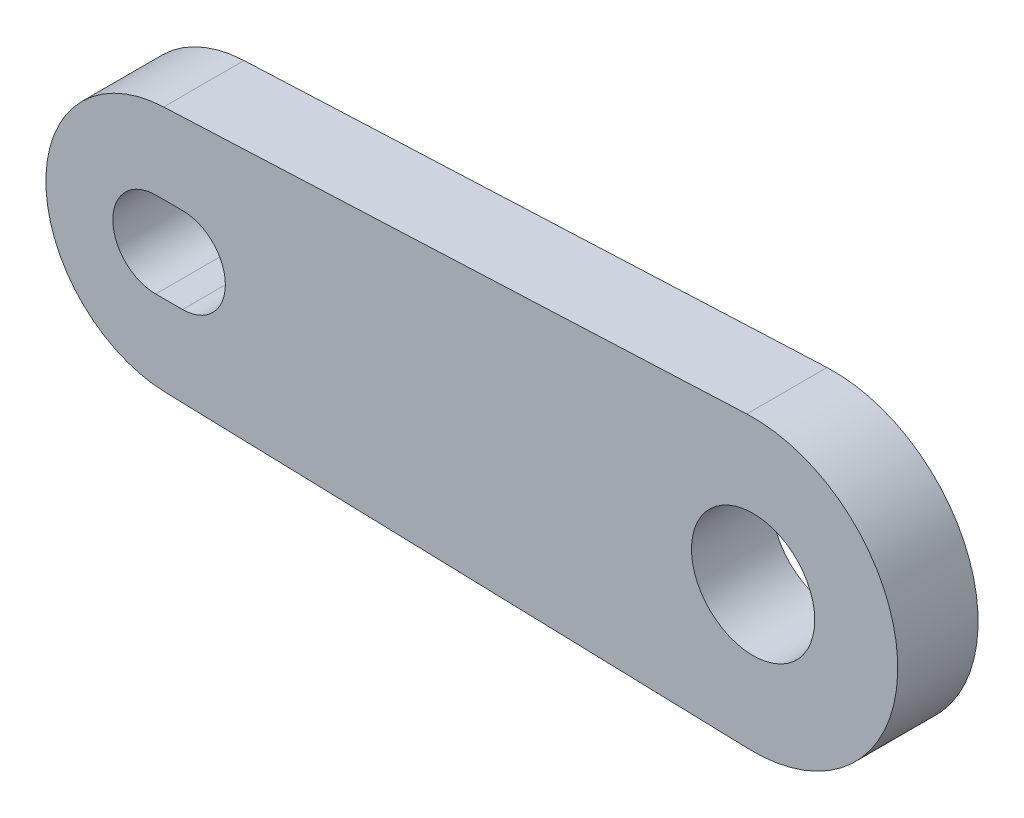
ISO-10303-21;
HEADER;
FILE_DESCRIPTION(('STEP AP214'),'2;1');
FILE_NAME('part.step','',(''),(''),'','','');
FILE_SCHEMA(('AUTOMOTIVE_DESIGN { 1 0 10303 214 1 1 1 1 }'));
ENDSEC;
DATA;
#1=APPLICATION_CONTEXT('core data for automotive mechanical design processes');
#2=APPLICATION_PROTOCOL_DEFINITION('international standard','automotive_design',2000,#1);
#3=PRODUCT_CONTEXT('',#1,'mechanical');
#4=PRODUCT('Part','Part','',(#3));
#5=PRODUCT_RELATED_PRODUCT_CATEGORY('part','',(#4));
#6=PRODUCT_DEFINITION_FORMATION('','',#4);
#7=PRODUCT_DEFINITION_CONTEXT('part definition',#1,'design');
#8=PRODUCT_DEFINITION('design','',#6,#7);
#9=PRODUCT_DEFINITION_SHAPE('','',#8);
#10=(LENGTH_UNIT() NAMED_UNIT(*) SI_UNIT(.MILLI.,.METRE.));
#11=(NAMED_UNIT(*) PLANE_ANGLE_UNIT() SI_UNIT($,.RADIAN.));
#12=(NAMED_UNIT(*) SI_UNIT($,.STERADIAN.) SOLID_ANGLE_UNIT());
#13=UNCERTAINTY_MEASURE_WITH_UNIT(LENGTH_MEASURE(1.E-05),#10,'distance_accuracy_value','');
#14=(GEOMETRIC_REPRESENTATION_CONTEXT(3) GLOBAL_UNCERTAINTY_ASSIGNED_CONTEXT((#13)) GLOBAL_UNIT_ASSIGNED_CONTEXT((#10,
#11,#12)) REPRESENTATION_CONTEXT('',''));
#15=CARTESIAN_POINT('',(0.,0.,0.));
#16=DIRECTION('',(0.,0.,1.));
#17=DIRECTION('',(1.,0.,0.));
#18=AXIS2_PLACEMENT_3D('',#15,#16,#17);
#19=CARTESIAN_POINT('',(0.0996517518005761,-5.24130689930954,-4.48174513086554));
#20=DIRECTION('',(0.,0.,1.));
#21=DIRECTION('',(1.,0.,0.));
#22=AXIS2_PLACEMENT_3D('',#19,#20,#21);
#23=PLANE('',#22);
#24=DIRECTION('',(1.,0.,0.));
#25=VECTOR('',#24,1.);
#26=CARTESIAN_POINT('',(-21.2000000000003,-7.00000000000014,-4.48174513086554));
#27=LINE('',#26,#25);
#28=CARTESIAN_POINT('',(-22.2000000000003,-7.00000000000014,-4.48174513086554));
#29=VERTEX_POINT('',#28);
#30=CARTESIAN_POINT('',(-21.2000000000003,-7.00000000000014,-4.48174513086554));
#31=VERTEX_POINT('',#30);
#32=EDGE_CURVE('E108',#29,#31,#27,.T.);
#33=ORIENTED_EDGE('',*,*,#32,.F.);
#34=CARTESIAN_POINT('',(-22.2000000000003,-5.40000000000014,-4.48174513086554));
#35=DIRECTION('',(0.,0.,1.));
#36=DIRECTION('',(-1.,0.,0.));
#37=AXIS2_PLACEMENT_3D('',#34,#35,#36);
#38=CIRCLE('',#37,1.6);
#39=CARTESIAN_POINT('',(-22.2000000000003,-3.80000000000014,-4.48174513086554));
#40=VERTEX_POINT('',#39);
#41=EDGE_CURVE('E100',#40,#29,#38,.T.);
#42=ORIENTED_EDGE('',*,*,#41,.F.);
#43=DIRECTION('',(-1.,0.,0.));
#44=VECTOR('',#43,1.);
#45=CARTESIAN_POINT('',(-21.2000000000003,-3.80000000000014,-4.48174513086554));
#46=LINE('',#45,#44);
#47=CARTESIAN_POINT('',(-21.2000000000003,-3.80000000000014,-4.48174513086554));
#48=VERTEX_POINT('',#47);
#49=EDGE_CURVE('E123',#48,#40,#46,.T.);
#50=ORIENTED_EDGE('',*,*,#49,.F.);
#51=CARTESIAN_POINT('',(-21.2000000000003,-5.40000000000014,-4.48174513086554));
#52=DIRECTION('',(0.,0.,1.));
#53=DIRECTION('',(1.,0.,0.));
#54=AXIS2_PLACEMENT_3D('',#51,#52,#53);
#55=CIRCLE('',#54,1.6);
#56=EDGE_CURVE('E121',#31,#48,#55,.T.);
#57=ORIENTED_EDGE('',*,*,#56,.F.);
#58=EDGE_LOOP('',(#33,#42,#50,#57));
#59=FACE_BOUND('',#58,.T.);
#60=CARTESIAN_POINT('',(0.0996517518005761,-5.24130689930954,-4.48174513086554));
#61=DIRECTION('',(0.,0.,1.));
#62=DIRECTION('',(1.,0.,0.));
#63=AXIS2_PLACEMENT_3D('',#60,#61,#62);
#64=CIRCLE('',#63,5.4);
#65=CARTESIAN_POINT('',(-0.0592236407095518,-10.6389692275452,-4.48174513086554));
#66=VERTEX_POINT('',#65);
#67=CARTESIAN_POINT('',(-0.13778846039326,0.153470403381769,-4.48174513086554));
#68=VERTEX_POINT('',#67);
#69=EDGE_CURVE('E147',#66,#68,#64,.T.);
#70=ORIENTED_EDGE('',*,*,#69,.T.);
#71=DIRECTION('',(-0.999032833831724,-0.0439704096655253,0.));
#72=VECTOR('',#71,1.);
#73=CARTESIAN_POINT('',(-0.13778846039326,0.153470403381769,-4.48174513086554));
#74=LINE('',#73,#72);
#75=CARTESIAN_POINT('',(-21.9022638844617,-0.804448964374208,-4.48174513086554));
#76=VERTEX_POINT('',#75);
#77=EDGE_CURVE('E150',#68,#76,#74,.T.);
#78=ORIENTED_EDGE('',*,*,#77,.T.);
#79=CARTESIAN_POINT('',(-21.7000000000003,-5.40000000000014,-4.48174513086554));
#80=DIRECTION('',(0.,0.,1.));
#81=DIRECTION('',(1.,0.,0.));
#82=AXIS2_PLACEMENT_3D('',#79,#80,#81);
#83=CIRCLE('',#82,4.6);
#84=CARTESIAN_POINT('',(-21.8353382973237,-9.9980086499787,-4.48174513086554));
#85=VERTEX_POINT('',#84);
#86=EDGE_CURVE('E153',#76,#85,#83,.T.);
#87=ORIENTED_EDGE('',*,*,#86,.T.);
#88=DIRECTION('',(0.999567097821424,-0.029421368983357,0.));
#89=VECTOR('',#88,1.);
#90=CARTESIAN_POINT('',(-0.0592236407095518,-10.6389692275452,-4.48174513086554));
#91=LINE('',#90,#89);
#92=EDGE_CURVE('E155',#85,#66,#91,.T.);
#93=ORIENTED_EDGE('',*,*,#92,.T.);
#94=EDGE_LOOP('',(#70,#78,#87,#93));
#95=FACE_BOUND('',#94,.T.);
#96=CARTESIAN_POINT('',(0.0996517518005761,-5.24130689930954,-4.48174513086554));
#97=DIRECTION('',(0.,0.,1.));
#98=DIRECTION('',(1.,0.,0.));
#99=AXIS2_PLACEMENT_3D('',#96,#97,#98);
#100=CIRCLE('',#99,2.3);
#101=CARTESIAN_POINT('',(2.39965175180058,-5.24130689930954,-4.48174513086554));
#102=VERTEX_POINT('',#101);
#103=EDGE_CURVE('E129',#102,#102,#100,.T.);
#104=ORIENTED_EDGE('',*,*,#103,.F.);
#105=EDGE_LOOP('',(#104));
#106=FACE_BOUND('',#105,.T.);
#107=ADVANCED_FACE('F35',(#59,#95,#106),#23,.T.);
#108=CARTESIAN_POINT('',(0.0996517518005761,-5.24130689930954,-7.48174513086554));
#109=DIRECTION('',(0.,0.,1.));
#110=DIRECTION('',(1.,0.,0.));
#111=AXIS2_PLACEMENT_3D('',#108,#109,#110);
#112=PLANE('',#111);
#113=CARTESIAN_POINT('',(-22.2000000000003,-5.40000000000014,-7.48174513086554));
#114=DIRECTION('',(0.,0.,1.));
#115=DIRECTION('',(-1.,0.,0.));
#116=AXIS2_PLACEMENT_3D('',#113,#114,#115);
#117=CIRCLE('',#116,1.6);
#118=CARTESIAN_POINT('',(-22.2000000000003,-3.80000000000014,-7.48174513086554));
#119=VERTEX_POINT('',#118);
#120=CARTESIAN_POINT('',(-22.2000000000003,-7.00000000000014,-7.48174513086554));
#121=VERTEX_POINT('',#120);
#122=EDGE_CURVE('E58',#119,#121,#117,.T.);
#123=ORIENTED_EDGE('',*,*,#122,.T.);
#124=DIRECTION('',(1.,0.,0.));
#125=VECTOR('',#124,1.);
#126=CARTESIAN_POINT('',(-21.2000000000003,-7.00000000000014,-7.48174513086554));
#127=LINE('',#126,#125);
#128=CARTESIAN_POINT('',(-21.2000000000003,-7.00000000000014,-7.48174513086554));
#129=VERTEX_POINT('',#128);
#130=EDGE_CURVE('E115',#121,#129,#127,.T.);
#131=ORIENTED_EDGE('',*,*,#130,.T.);
#132=CARTESIAN_POINT('',(-21.2000000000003,-5.40000000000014,-7.48174513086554));
#133=DIRECTION('',(0.,0.,1.));
#134=DIRECTION('',(1.,0.,0.));
#135=AXIS2_PLACEMENT_3D('',#132,#133,#134);
#136=CIRCLE('',#135,1.6);
#137=CARTESIAN_POINT('',(-21.2000000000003,-3.80000000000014,-7.48174513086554));
#138=VERTEX_POINT('',#137);
#139=EDGE_CURVE('E138',#129,#138,#136,.T.);
#140=ORIENTED_EDGE('',*,*,#139,.T.);
#141=DIRECTION('',(-1.,0.,0.));
#142=VECTOR('',#141,1.);
#143=CARTESIAN_POINT('',(-21.2000000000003,-3.80000000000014,-7.48174513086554));
#144=LINE('',#143,#142);
#145=EDGE_CURVE('E109',#138,#119,#144,.T.);
#146=ORIENTED_EDGE('',*,*,#145,.T.);
#147=EDGE_LOOP('',(#123,#131,#140,#146));
#148=FACE_BOUND('',#147,.T.);
#149=CARTESIAN_POINT('',(0.0996517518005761,-5.24130689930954,-7.48174513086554));
#150=DIRECTION('',(0.,0.,1.));
#151=DIRECTION('',(1.,0.,0.));
#152=AXIS2_PLACEMENT_3D('',#149,#150,#151);
#153=CIRCLE('',#152,5.4);
#154=CARTESIAN_POINT('',(-0.0592236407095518,-10.6389692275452,-7.48174513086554));
#155=VERTEX_POINT('',#154);
#156=CARTESIAN_POINT('',(-0.13778846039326,0.153470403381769,-7.48174513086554));
#157=VERTEX_POINT('',#156);
#158=EDGE_CURVE('E116',#155,#157,#153,.T.);
#159=ORIENTED_EDGE('',*,*,#158,.F.);
#160=DIRECTION('',(0.999567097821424,-0.029421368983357,0.));
#161=VECTOR('',#160,1.);
#162=CARTESIAN_POINT('',(-0.0592236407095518,-10.6389692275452,-7.48174513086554));
#163=LINE('',#162,#161);
#164=CARTESIAN_POINT('',(-21.8353382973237,-9.9980086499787,-7.48174513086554));
#165=VERTEX_POINT('',#164);
#166=EDGE_CURVE('E151',#165,#155,#163,.T.);
#167=ORIENTED_EDGE('',*,*,#166,.F.);
#168=CARTESIAN_POINT('',(-21.7000000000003,-5.40000000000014,-7.48174513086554));
#169=DIRECTION('',(0.,0.,1.));
#170=DIRECTION('',(1.,0.,0.));
#171=AXIS2_PLACEMENT_3D('',#168,#169,#170);
#172=CIRCLE('',#171,4.6);
#173=CARTESIAN_POINT('',(-21.9022638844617,-0.804448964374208,-7.48174513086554));
#174=VERTEX_POINT('',#173);
#175=EDGE_CURVE('E169',#174,#165,#172,.T.);
#176=ORIENTED_EDGE('',*,*,#175,.F.);
#177=DIRECTION('',(-0.999032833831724,-0.0439704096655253,0.));
#178=VECTOR('',#177,1.);
#179=CARTESIAN_POINT('',(-0.13778846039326,0.153470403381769,-7.48174513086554));
#180=LINE('',#179,#178);
#181=EDGE_CURVE('E161',#157,#174,#180,.T.);
#182=ORIENTED_EDGE('',*,*,#181,.F.);
#183=EDGE_LOOP('',(#159,#167,#176,#182));
#184=FACE_BOUND('',#183,.T.);
#185=CARTESIAN_POINT('',(0.0996517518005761,-5.24130689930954,-7.48174513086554));
#186=DIRECTION('',(0.,0.,1.));
#187=DIRECTION('',(1.,0.,0.));
#188=AXIS2_PLACEMENT_3D('',#185,#186,#187);
#189=CIRCLE('',#188,2.3);
#190=CARTESIAN_POINT('',(2.39965175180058,-5.24130689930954,-7.48174513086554));
#191=VERTEX_POINT('',#190);
#192=EDGE_CURVE('E202',#191,#191,#189,.T.);
#193=ORIENTED_EDGE('',*,*,#192,.T.);
#194=EDGE_LOOP('',(#193));
#195=FACE_BOUND('',#194,.T.);
#196=ADVANCED_FACE('F186',(#148,#184,#195),#112,.F.);
#197=CARTESIAN_POINT('',(0.0996517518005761,-5.24130689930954,-4.48174513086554));
#198=DIRECTION('',(0.,0.,-1.));
#199=DIRECTION('',(-1.,0.,0.));
#200=AXIS2_PLACEMENT_3D('',#197,#198,#199);
#201=CYLINDRICAL_SURFACE('',#200,5.4);
#202=ORIENTED_EDGE('',*,*,#158,.T.);
#203=DIRECTION('',(0.,0.,-1.));
#204=VECTOR('',#203,1.);
#205=CARTESIAN_POINT('',(-0.13778846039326,0.153470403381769,-4.48174513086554));
#206=LINE('',#205,#204);
#207=EDGE_CURVE('E12',#68,#157,#206,.T.);
#208=ORIENTED_EDGE('',*,*,#207,.F.);
#209=ORIENTED_EDGE('',*,*,#69,.F.);
#210=DIRECTION('',(0.,0.,-1.));
#211=VECTOR('',#210,1.);
#212=CARTESIAN_POINT('',(-0.0592236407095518,-10.6389692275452,-4.48174513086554));
#213=LINE('',#212,#211);
#214=EDGE_CURVE('E157',#66,#155,#213,.T.);
#215=ORIENTED_EDGE('',*,*,#214,.T.);
#216=EDGE_LOOP('',(#202,#208,#209,#215));
#217=FACE_BOUND('',#216,.T.);
#218=ADVANCED_FACE('F37',(#217),#201,.T.);
#219=CARTESIAN_POINT('',(-0.13778846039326,0.153470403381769,-4.48174513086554));
#220=DIRECTION('',(0.0439704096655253,-0.999032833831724,0.));
#221=DIRECTION('',(0.999032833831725,0.0439704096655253,0.));
#222=AXIS2_PLACEMENT_3D('',#219,#220,#221);
#223=PLANE('',#222);
#224=ORIENTED_EDGE('',*,*,#181,.T.);
#225=DIRECTION('',(0.,0.,-1.));
#226=VECTOR('',#225,1.);
#227=CARTESIAN_POINT('',(-21.9022638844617,-0.804448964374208,-4.48174513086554));
#228=LINE('',#227,#226);
#229=EDGE_CURVE('E43',#76,#174,#228,.T.);
#230=ORIENTED_EDGE('',*,*,#229,.F.);
#231=ORIENTED_EDGE('',*,*,#77,.F.);
#232=ORIENTED_EDGE('',*,*,#207,.T.);
#233=EDGE_LOOP('',(#224,#230,#231,#232));
#234=FACE_BOUND('',#233,.T.);
#235=ADVANCED_FACE('F188',(#234),#223,.F.);
#236=CARTESIAN_POINT('',(-21.7000000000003,-5.40000000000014,-4.48174513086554));
#237=DIRECTION('',(0.,0.,-1.));
#238=DIRECTION('',(-1.,0.,0.));
#239=AXIS2_PLACEMENT_3D('',#236,#237,#238);
#240=CYLINDRICAL_SURFACE('',#239,4.6);
#241=ORIENTED_EDGE('',*,*,#175,.T.);
#242=DIRECTION('',(0.,0.,-1.));
#243=VECTOR('',#242,1.);
#244=CARTESIAN_POINT('',(-21.8353382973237,-9.9980086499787,-4.48174513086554));
#245=LINE('',#244,#243);
#246=EDGE_CURVE('E173',#85,#165,#245,.T.);
#247=ORIENTED_EDGE('',*,*,#246,.F.);
#248=ORIENTED_EDGE('',*,*,#86,.F.);
#249=ORIENTED_EDGE('',*,*,#229,.T.);
#250=EDGE_LOOP('',(#241,#247,#248,#249));
#251=FACE_BOUND('',#250,.T.);
#252=ADVANCED_FACE('F180',(#251),#240,.T.);
#253=CARTESIAN_POINT('',(-0.0592236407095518,-10.6389692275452,-4.48174513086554));
#254=DIRECTION('',(0.029421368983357,0.999567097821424,0.));
#255=DIRECTION('',(-0.999567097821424,0.029421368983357,0.));
#256=AXIS2_PLACEMENT_3D('',#253,#254,#255);
#257=PLANE('',#256);
#258=ORIENTED_EDGE('',*,*,#166,.T.);
#259=ORIENTED_EDGE('',*,*,#214,.F.);
#260=ORIENTED_EDGE('',*,*,#92,.F.);
#261=ORIENTED_EDGE('',*,*,#246,.T.);
#262=EDGE_LOOP('',(#258,#259,#260,#261));
#263=FACE_BOUND('',#262,.T.);
#264=ADVANCED_FACE('F195',(#263),#257,.F.);
#265=CARTESIAN_POINT('',(-22.2000000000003,-5.40000000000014,-4.48174513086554));
#266=DIRECTION('',(0.,0.,-1.));
#267=DIRECTION('',(-1.,0.,0.));
#268=AXIS2_PLACEMENT_3D('',#265,#266,#267);
#269=CYLINDRICAL_SURFACE('',#268,1.6);
#270=ORIENTED_EDGE('',*,*,#122,.F.);
#271=DIRECTION('',(0.,0.,-1.));
#272=VECTOR('',#271,1.);
#273=CARTESIAN_POINT('',(-22.2000000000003,-3.80000000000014,-4.48174513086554));
#274=LINE('',#273,#272);
#275=EDGE_CURVE('E104',#40,#119,#274,.T.);
#276=ORIENTED_EDGE('',*,*,#275,.F.);
#277=ORIENTED_EDGE('',*,*,#41,.T.);
#278=DIRECTION('',(0.,0.,-1.));
#279=VECTOR('',#278,1.);
#280=CARTESIAN_POINT('',(-22.2000000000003,-7.00000000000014,-4.48174513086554));
#281=LINE('',#280,#279);
#282=EDGE_CURVE('E103',#29,#121,#281,.T.);
#283=ORIENTED_EDGE('',*,*,#282,.T.);
#284=EDGE_LOOP('',(#270,#276,#277,#283));
#285=FACE_BOUND('',#284,.T.);
#286=ADVANCED_FACE('F102',(#285),#269,.F.);
#287=CARTESIAN_POINT('',(-21.2000000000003,-7.00000000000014,-4.48174513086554));
#288=DIRECTION('',(0.,1.,0.));
#289=DIRECTION('',(0.,0.,1.));
#290=AXIS2_PLACEMENT_3D('',#287,#288,#289);
#291=PLANE('',#290);
#292=ORIENTED_EDGE('',*,*,#130,.F.);
#293=ORIENTED_EDGE('',*,*,#282,.F.);
#294=ORIENTED_EDGE('',*,*,#32,.T.);
#295=DIRECTION('',(0.,0.,-1.));
#296=VECTOR('',#295,1.);
#297=CARTESIAN_POINT('',(-21.2000000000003,-7.00000000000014,-4.48174513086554));
#298=LINE('',#297,#296);
#299=EDGE_CURVE('E117',#31,#129,#298,.T.);
#300=ORIENTED_EDGE('',*,*,#299,.T.);
#301=EDGE_LOOP('',(#292,#293,#294,#300));
#302=FACE_BOUND('',#301,.T.);
#303=ADVANCED_FACE('F112',(#302),#291,.T.);
#304=CARTESIAN_POINT('',(-21.2000000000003,-5.40000000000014,-4.48174513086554));
#305=DIRECTION('',(0.,0.,-1.));
#306=DIRECTION('',(-1.,0.,0.));
#307=AXIS2_PLACEMENT_3D('',#304,#305,#306);
#308=CYLINDRICAL_SURFACE('',#307,1.6);
#309=ORIENTED_EDGE('',*,*,#139,.F.);
#310=ORIENTED_EDGE('',*,*,#299,.F.);
#311=ORIENTED_EDGE('',*,*,#56,.T.);
#312=DIRECTION('',(0.,0.,-1.));
#313=VECTOR('',#312,1.);
#314=CARTESIAN_POINT('',(-21.2000000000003,-3.80000000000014,-4.48174513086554));
#315=LINE('',#314,#313);
#316=EDGE_CURVE('E50',#48,#138,#315,.T.);
#317=ORIENTED_EDGE('',*,*,#316,.T.);
#318=EDGE_LOOP('',(#309,#310,#311,#317));
#319=FACE_BOUND('',#318,.T.);
#320=ADVANCED_FACE('F215',(#319),#308,.F.);
#321=CARTESIAN_POINT('',(-21.2000000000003,-3.80000000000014,-4.48174513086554));
#322=DIRECTION('',(0.,-1.,0.));
#323=DIRECTION('',(0.,0.,-1.));
#324=AXIS2_PLACEMENT_3D('',#321,#322,#323);
#325=PLANE('',#324);
#326=ORIENTED_EDGE('',*,*,#145,.F.);
#327=ORIENTED_EDGE('',*,*,#316,.F.);
#328=ORIENTED_EDGE('',*,*,#49,.T.);
#329=ORIENTED_EDGE('',*,*,#275,.T.);
#330=EDGE_LOOP('',(#326,#327,#328,#329));
#331=FACE_BOUND('',#330,.T.);
#332=ADVANCED_FACE('F210',(#331),#325,.T.);
#333=CARTESIAN_POINT('',(0.0996517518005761,-5.24130689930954,-4.48174513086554));
#334=DIRECTION('',(0.,0.,-1.));
#335=DIRECTION('',(-1.,0.,0.));
#336=AXIS2_PLACEMENT_3D('',#333,#334,#335);
#337=CYLINDRICAL_SURFACE('',#336,2.3);
#338=ORIENTED_EDGE('',*,*,#103,.T.);
#339=EDGE_LOOP('',(#338));
#340=FACE_BOUND('',#339,.T.);
#341=ORIENTED_EDGE('',*,*,#192,.F.);
#342=EDGE_LOOP('',(#341));
#343=FACE_BOUND('',#342,.T.);
#344=ADVANCED_FACE('F208',(#340,#343),#337,.F.);
#345=CLOSED_SHELL('',(#107,#196,#218,#235,#252,#264,#286,#303,#320,#332,#344));
#346=MANIFOLD_SOLID_BREP('B2',#345);
#347=ADVANCED_BREP_SHAPE_REPRESENTATION('',(#18,#346),#14);
#348=SHAPE_DEFINITION_REPRESENTATION(#9,#347);
ENDSEC;
END-ISO-10303-21;
